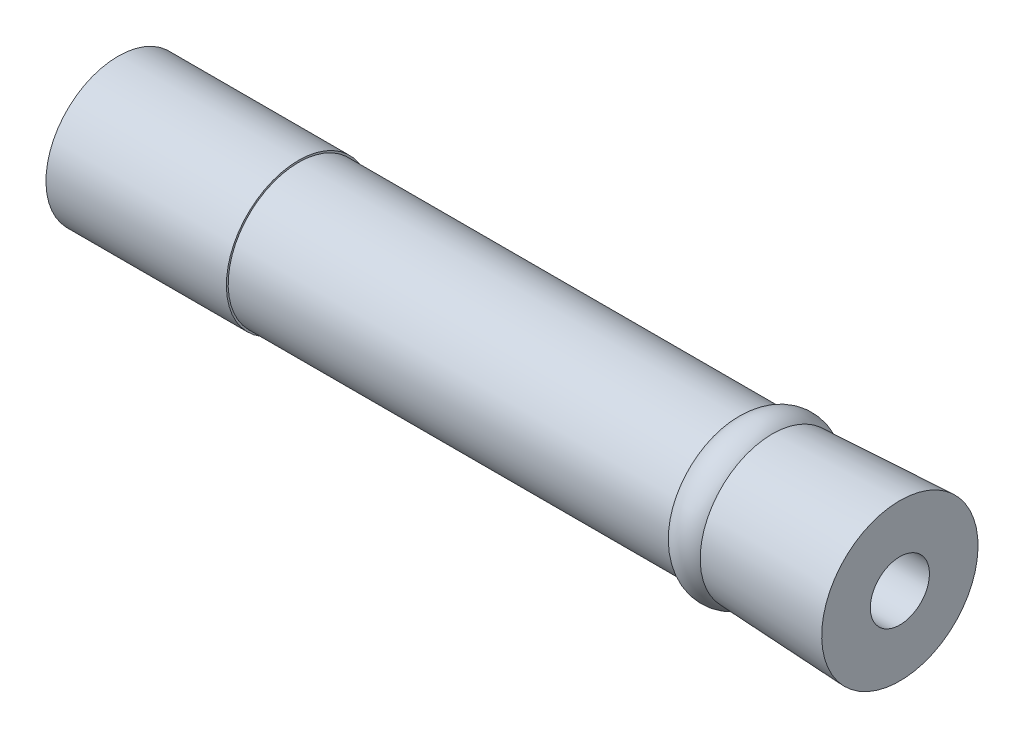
ISO-10303-21;
HEADER;
FILE_DESCRIPTION(('STEP AP214'),'2;1');
FILE_NAME('part.step','',(''),(''),'','','');
FILE_SCHEMA(('AUTOMOTIVE_DESIGN { 1 0 10303 214 1 1 1 1 }'));
ENDSEC;
DATA;
#1=APPLICATION_CONTEXT('core data for automotive mechanical design processes');
#2=APPLICATION_PROTOCOL_DEFINITION('international standard','automotive_design',2000,#1);
#3=PRODUCT_CONTEXT('',#1,'mechanical');
#4=PRODUCT('Part','Part','',(#3));
#5=PRODUCT_RELATED_PRODUCT_CATEGORY('part','',(#4));
#6=PRODUCT_DEFINITION_FORMATION('','',#4);
#7=PRODUCT_DEFINITION_CONTEXT('part definition',#1,'design');
#8=PRODUCT_DEFINITION('design','',#6,#7);
#9=PRODUCT_DEFINITION_SHAPE('','',#8);
#10=(LENGTH_UNIT() NAMED_UNIT(*) SI_UNIT(.MILLI.,.METRE.));
#11=(NAMED_UNIT(*) PLANE_ANGLE_UNIT() SI_UNIT($,.RADIAN.));
#12=(NAMED_UNIT(*) SI_UNIT($,.STERADIAN.) SOLID_ANGLE_UNIT());
#13=UNCERTAINTY_MEASURE_WITH_UNIT(LENGTH_MEASURE(1.E-05),#10,'distance_accuracy_value','');
#14=(GEOMETRIC_REPRESENTATION_CONTEXT(3) GLOBAL_UNCERTAINTY_ASSIGNED_CONTEXT((#13)) GLOBAL_UNIT_ASSIGNED_CONTEXT((#10,
#11,#12)) REPRESENTATION_CONTEXT('',''));
#15=CARTESIAN_POINT('',(0.,0.,0.));
#16=DIRECTION('',(0.,0.,1.));
#17=DIRECTION('',(1.,0.,0.));
#18=AXIS2_PLACEMENT_3D('',#15,#16,#17);
#19=CARTESIAN_POINT('',(-30.0000000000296,0.,0.));
#20=DIRECTION('',(1.,0.,0.));
#21=DIRECTION('',(0.,1.,0.));
#22=AXIS2_PLACEMENT_3D('',#19,#20,#21);
#23=CONICAL_SURFACE('',#22,2.45849999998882,1.02974425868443);
#24=CARTESIAN_POINT('',(-31.4772158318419,0.,0.));
#25=VERTEX_POINT('',#24);
#26=VERTEX_LOOP('',#25);
#27=FACE_BOUND('',#26,.T.);
#28=CARTESIAN_POINT('',(-30.,0.,0.));
#29=DIRECTION('',(1.,0.,0.));
#30=DIRECTION('',(0.,1.,0.));
#31=AXIS2_PLACEMENT_3D('',#28,#29,#30);
#32=CIRCLE('',#31,2.4585);
#33=CARTESIAN_POINT('',(-30.,2.4585,0.));
#34=VERTEX_POINT('',#33);
#35=EDGE_CURVE('E35',#34,#34,#32,.T.);
#36=ORIENTED_EDGE('',*,*,#35,.T.);
#37=EDGE_LOOP('',(#36));
#38=FACE_BOUND('',#37,.T.);
#39=ADVANCED_FACE('F17',(#27,#38),#23,.F.);
#40=CARTESIAN_POINT('',(-15.,0.,0.));
#41=DIRECTION('',(1.,0.,0.));
#42=DIRECTION('',(0.,1.,0.));
#43=AXIS2_PLACEMENT_3D('',#40,#41,#42);
#44=CYLINDRICAL_SURFACE('',#43,2.4585);
#45=CARTESIAN_POINT('',(0.,0.,0.));
#46=DIRECTION('',(1.,0.,0.));
#47=DIRECTION('',(0.,1.,0.));
#48=AXIS2_PLACEMENT_3D('',#45,#46,#47);
#49=CIRCLE('',#48,2.4585);
#50=CARTESIAN_POINT('',(0.,2.4585,0.));
#51=VERTEX_POINT('',#50);
#52=EDGE_CURVE('E21',#51,#51,#49,.F.);
#53=ORIENTED_EDGE('',*,*,#52,.F.);
#54=EDGE_LOOP('',(#53));
#55=FACE_BOUND('',#54,.T.);
#56=ORIENTED_EDGE('',*,*,#35,.F.);
#57=EDGE_LOOP('',(#56));
#58=FACE_BOUND('',#57,.T.);
#59=ADVANCED_FACE('F31',(#55,#58),#44,.F.);
#60=CARTESIAN_POINT('',(0.,3.25,0.));
#61=DIRECTION('',(1.,0.,0.));
#62=DIRECTION('',(0.,0.,-1.));
#63=AXIS2_PLACEMENT_3D('',#60,#61,#62);
#64=PLANE('',#63);
#65=CARTESIAN_POINT('',(-3.21875859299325E-12,0.,0.));
#66=DIRECTION('',(1.,0.,0.));
#67=DIRECTION('',(0.,1.,0.));
#68=AXIS2_PLACEMENT_3D('',#65,#66,#67);
#69=CIRCLE('',#68,6.50000000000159);
#70=CARTESIAN_POINT('',(-3.21964677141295E-12,6.50000000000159,0.));
#71=VERTEX_POINT('',#70);
#72=EDGE_CURVE('E39',#71,#71,#69,.F.);
#73=ORIENTED_EDGE('',*,*,#72,.F.);
#74=EDGE_LOOP('',(#73));
#75=FACE_BOUND('',#74,.T.);
#76=ORIENTED_EDGE('',*,*,#52,.T.);
#77=EDGE_LOOP('',(#76));
#78=FACE_BOUND('',#77,.T.);
#79=ADVANCED_FACE('F56',(#75,#78),#64,.T.);
#80=CARTESIAN_POINT('',(-65.,2.99999999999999,0.));
#81=DIRECTION('',(-1.,0.,0.));
#82=DIRECTION('',(0.,-1.,0.));
#83=AXIS2_PLACEMENT_3D('',#80,#81,#82);
#84=PLANE('',#83);
#85=CARTESIAN_POINT('',(-65.,0.,0.));
#86=DIRECTION('',(1.,0.,0.));
#87=DIRECTION('',(0.,1.,0.));
#88=AXIS2_PLACEMENT_3D('',#85,#86,#87);
#89=CIRCLE('',#88,6.);
#90=CARTESIAN_POINT('',(-65.,5.99999999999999,0.));
#91=VERTEX_POINT('',#90);
#92=EDGE_CURVE('E48',#91,#91,#89,.T.);
#93=ORIENTED_EDGE('',*,*,#92,.F.);
#94=EDGE_LOOP('',(#93));
#95=FACE_BOUND('',#94,.T.);
#96=ADVANCED_FACE('F59',(#95),#84,.T.);
#97=CARTESIAN_POINT('',(-5.68425306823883E-11,0.,0.));
#98=DIRECTION('',(1.,0.,0.));
#99=DIRECTION('',(0.,1.,0.));
#100=AXIS2_PLACEMENT_3D('',#97,#98,#99);
#101=CONICAL_SURFACE('',#100,6.49999999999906,0.0471253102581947);
#102=ORIENTED_EDGE('',*,*,#72,.T.);
#103=EDGE_LOOP('',(#102));
#104=FACE_BOUND('',#103,.T.);
#105=CARTESIAN_POINT('',(-10.602154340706,0.,0.));
#106=DIRECTION('',(1.,0.,0.));
#107=DIRECTION('',(0.,0.,-1.));
#108=AXIS2_PLACEMENT_3D('',#105,#106,#107);
#109=CIRCLE('',#108,6.);
#110=CARTESIAN_POINT('',(-10.602154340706,0.,-6.));
#111=VERTEX_POINT('',#110);
#112=EDGE_CURVE('E47',#111,#111,#109,.F.);
#113=ORIENTED_EDGE('',*,*,#112,.F.);
#114=EDGE_LOOP('',(#113));
#115=FACE_BOUND('',#114,.T.);
#116=ADVANCED_FACE('F53',(#104,#115),#101,.T.);
#117=CARTESIAN_POINT('',(-57.5,0.,0.));
#118=DIRECTION('',(1.,0.,0.));
#119=DIRECTION('',(0.,1.,0.));
#120=AXIS2_PLACEMENT_3D('',#117,#118,#119);
#121=CYLINDRICAL_SURFACE('',#120,6.);
#122=CARTESIAN_POINT('',(-50.,0.,0.));
#123=DIRECTION('',(1.,0.,0.));
#124=DIRECTION('',(0.,1.,0.));
#125=AXIS2_PLACEMENT_3D('',#122,#123,#124);
#126=CIRCLE('',#125,6.);
#127=CARTESIAN_POINT('',(-50.,5.99999999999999,0.));
#128=VERTEX_POINT('',#127);
#129=EDGE_CURVE('E44',#128,#128,#126,.T.);
#130=ORIENTED_EDGE('',*,*,#129,.F.);
#131=EDGE_LOOP('',(#130));
#132=FACE_BOUND('',#131,.T.);
#133=ORIENTED_EDGE('',*,*,#92,.T.);
#134=EDGE_LOOP('',(#133));
#135=FACE_BOUND('',#134,.T.);
#136=ADVANCED_FACE('F89',(#132,#135),#121,.T.);
#137=CARTESIAN_POINT('',(-11.9250299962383,0.,0.));
#138=DIRECTION('',(1.,0.,0.));
#139=DIRECTION('',(0.,0.,-1.));
#140=AXIS2_PLACEMENT_3D('',#137,#138,#139);
#141=TOROIDAL_SURFACE('',#140,4.5,2.);
#142=CARTESIAN_POINT('',(-13.4006654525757,0.,0.));
#143=DIRECTION('',(1.,0.,0.));
#144=DIRECTION('',(0.,1.,0.));
#145=AXIS2_PLACEMENT_3D('',#142,#143,#144);
#146=CIRCLE('',#145,5.85);
#147=CARTESIAN_POINT('',(-13.4006654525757,5.85,0.));
#148=VERTEX_POINT('',#147);
#149=EDGE_CURVE('E25',#148,#148,#146,.F.);
#150=ORIENTED_EDGE('',*,*,#149,.F.);
#151=EDGE_LOOP('',(#150));
#152=FACE_BOUND('',#151,.T.);
#153=ORIENTED_EDGE('',*,*,#112,.T.);
#154=EDGE_LOOP('',(#153));
#155=FACE_BOUND('',#154,.T.);
#156=ADVANCED_FACE('F74',(#152,#155),#141,.T.);
#157=CARTESIAN_POINT('',(-50.,5.92499999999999,0.));
#158=DIRECTION('',(1.,0.,0.));
#159=DIRECTION('',(0.,0.,-1.));
#160=AXIS2_PLACEMENT_3D('',#157,#158,#159);
#161=PLANE('',#160);
#162=ORIENTED_EDGE('',*,*,#129,.T.);
#163=EDGE_LOOP('',(#162));
#164=FACE_BOUND('',#163,.T.);
#165=CARTESIAN_POINT('',(-50.,0.,0.));
#166=DIRECTION('',(1.,0.,0.));
#167=DIRECTION('',(0.,1.,0.));
#168=AXIS2_PLACEMENT_3D('',#165,#166,#167);
#169=CIRCLE('',#168,5.85);
#170=CARTESIAN_POINT('',(-50.,5.84999999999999,0.));
#171=VERTEX_POINT('',#170);
#172=EDGE_CURVE('E11',#171,#171,#169,.T.);
#173=ORIENTED_EDGE('',*,*,#172,.F.);
#174=EDGE_LOOP('',(#173));
#175=FACE_BOUND('',#174,.T.);
#176=ADVANCED_FACE('F69',(#164,#175),#161,.T.);
#177=CARTESIAN_POINT('',(-31.7003327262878,0.,0.));
#178=DIRECTION('',(1.,0.,0.));
#179=DIRECTION('',(0.,1.,0.));
#180=AXIS2_PLACEMENT_3D('',#177,#178,#179);
#181=CYLINDRICAL_SURFACE('',#180,5.85);
#182=ORIENTED_EDGE('',*,*,#149,.T.);
#183=EDGE_LOOP('',(#182));
#184=FACE_BOUND('',#183,.T.);
#185=ORIENTED_EDGE('',*,*,#172,.T.);
#186=EDGE_LOOP('',(#185));
#187=FACE_BOUND('',#186,.T.);
#188=ADVANCED_FACE('F19',(#184,#187),#181,.T.);
#189=CLOSED_SHELL('',(#39,#59,#79,#96,#116,#136,#156,#176,#188));
#190=MANIFOLD_SOLID_BREP('B1',#189);
#191=ADVANCED_BREP_SHAPE_REPRESENTATION('',(#18,#190),#14);
#192=SHAPE_DEFINITION_REPRESENTATION(#9,#191);
ENDSEC;
END-ISO-10303-21;
